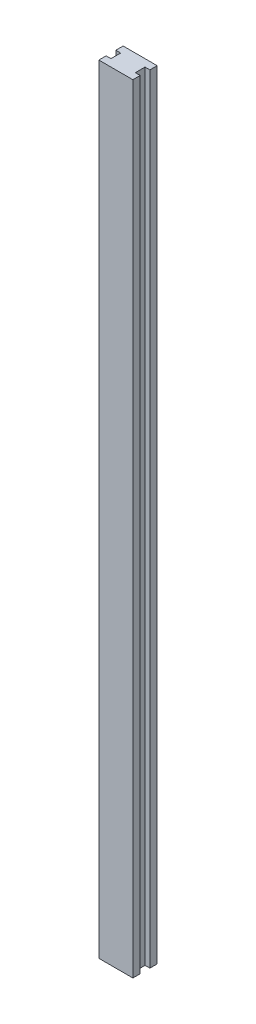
ISO-10303-21;
HEADER;
FILE_DESCRIPTION(('STEP AP214'),'2;1');
FILE_NAME('part.step','',(''),(''),'','','');
FILE_SCHEMA(('AUTOMOTIVE_DESIGN { 1 0 10303 214 1 1 1 1 }'));
ENDSEC;
DATA;
#1=APPLICATION_CONTEXT('core data for automotive mechanical design processes');
#2=APPLICATION_PROTOCOL_DEFINITION('international standard','automotive_design',2000,#1);
#3=PRODUCT_CONTEXT('',#1,'mechanical');
#4=PRODUCT('Part','Part','',(#3));
#5=PRODUCT_RELATED_PRODUCT_CATEGORY('part','',(#4));
#6=PRODUCT_DEFINITION_FORMATION('','',#4);
#7=PRODUCT_DEFINITION_CONTEXT('part definition',#1,'design');
#8=PRODUCT_DEFINITION('design','',#6,#7);
#9=PRODUCT_DEFINITION_SHAPE('','',#8);
#10=(LENGTH_UNIT() NAMED_UNIT(*) SI_UNIT(.MILLI.,.METRE.));
#11=(NAMED_UNIT(*) PLANE_ANGLE_UNIT() SI_UNIT($,.RADIAN.));
#12=(NAMED_UNIT(*) SI_UNIT($,.STERADIAN.) SOLID_ANGLE_UNIT());
#13=UNCERTAINTY_MEASURE_WITH_UNIT(LENGTH_MEASURE(1.E-05),#10,'distance_accuracy_value','');
#14=(GEOMETRIC_REPRESENTATION_CONTEXT(3) GLOBAL_UNCERTAINTY_ASSIGNED_CONTEXT((#13)) GLOBAL_UNIT_ASSIGNED_CONTEXT((#10,
#11,#12)) REPRESENTATION_CONTEXT('',''));
#15=CARTESIAN_POINT('',(0.,0.,0.));
#16=DIRECTION('',(0.,0.,1.));
#17=DIRECTION('',(1.,0.,0.));
#18=AXIS2_PLACEMENT_3D('',#15,#16,#17);
#19=CARTESIAN_POINT('',(3.5,160.,-1.));
#20=DIRECTION('',(-1.,0.,0.));
#21=DIRECTION('',(0.,0.,1.));
#22=AXIS2_PLACEMENT_3D('',#19,#20,#21);
#23=PLANE('',#22);
#24=DIRECTION('',(0.,0.,-1.));
#25=VECTOR('',#24,1.);
#26=CARTESIAN_POINT('',(3.5,0.,-1.));
#27=LINE('',#26,#25);
#28=CARTESIAN_POINT('',(3.5,0.,-1.));
#29=VERTEX_POINT('',#28);
#30=CARTESIAN_POINT('',(3.5,0.,-2.5));
#31=VERTEX_POINT('',#30);
#32=EDGE_CURVE('E161',#29,#31,#27,.T.);
#33=ORIENTED_EDGE('',*,*,#32,.T.);
#34=DIRECTION('',(0.,-1.,0.));
#35=VECTOR('',#34,1.);
#36=CARTESIAN_POINT('',(3.5,160.,-2.5));
#37=LINE('',#36,#35);
#38=CARTESIAN_POINT('',(3.5,160.,-2.5));
#39=VERTEX_POINT('',#38);
#40=EDGE_CURVE('E11',#39,#31,#37,.T.);
#41=ORIENTED_EDGE('',*,*,#40,.F.);
#42=DIRECTION('',(0.,0.,-1.));
#43=VECTOR('',#42,1.);
#44=CARTESIAN_POINT('',(3.5,160.,-1.));
#45=LINE('',#44,#43);
#46=CARTESIAN_POINT('',(3.5,160.,-1.));
#47=VERTEX_POINT('',#46);
#48=EDGE_CURVE('E183',#47,#39,#45,.T.);
#49=ORIENTED_EDGE('',*,*,#48,.F.);
#50=DIRECTION('',(0.,-1.,0.));
#51=VECTOR('',#50,1.);
#52=CARTESIAN_POINT('',(3.5,160.,-1.));
#53=LINE('',#52,#51);
#54=EDGE_CURVE('E157',#47,#29,#53,.T.);
#55=ORIENTED_EDGE('',*,*,#54,.T.);
#56=EDGE_LOOP('',(#33,#41,#49,#55));
#57=FACE_BOUND('',#56,.T.);
#58=ADVANCED_FACE('F41',(#57),#23,.F.);
#59=CARTESIAN_POINT('',(-3.5,160.,-2.5));
#60=DIRECTION('',(0.,0.,1.));
#61=DIRECTION('',(1.,0.,0.));
#62=AXIS2_PLACEMENT_3D('',#59,#60,#61);
#63=PLANE('',#62);
#64=DIRECTION('',(-1.,0.,0.));
#65=VECTOR('',#64,1.);
#66=CARTESIAN_POINT('',(-3.5,0.,-2.5));
#67=LINE('',#66,#65);
#68=CARTESIAN_POINT('',(-3.5,0.,-2.5));
#69=VERTEX_POINT('',#68);
#70=EDGE_CURVE('E164',#31,#69,#67,.T.);
#71=ORIENTED_EDGE('',*,*,#70,.T.);
#72=DIRECTION('',(0.,-1.,0.));
#73=VECTOR('',#72,1.);
#74=CARTESIAN_POINT('',(-3.5,160.,-2.5));
#75=LINE('',#74,#73);
#76=CARTESIAN_POINT('',(-3.5,160.,-2.5));
#77=VERTEX_POINT('',#76);
#78=EDGE_CURVE('E49',#77,#69,#75,.T.);
#79=ORIENTED_EDGE('',*,*,#78,.F.);
#80=DIRECTION('',(-1.,0.,0.));
#81=VECTOR('',#80,1.);
#82=CARTESIAN_POINT('',(-3.5,160.,-2.5));
#83=LINE('',#82,#81);
#84=EDGE_CURVE('E112',#39,#77,#83,.T.);
#85=ORIENTED_EDGE('',*,*,#84,.F.);
#86=ORIENTED_EDGE('',*,*,#40,.T.);
#87=EDGE_LOOP('',(#71,#79,#85,#86));
#88=FACE_BOUND('',#87,.T.);
#89=ADVANCED_FACE('F261',(#88),#63,.F.);
#90=CARTESIAN_POINT('',(-3.5,160.,-1.));
#91=DIRECTION('',(1.,0.,0.));
#92=DIRECTION('',(0.,0.,-1.));
#93=AXIS2_PLACEMENT_3D('',#90,#91,#92);
#94=PLANE('',#93);
#95=DIRECTION('',(0.,0.,1.));
#96=VECTOR('',#95,1.);
#97=CARTESIAN_POINT('',(-3.5,0.,-1.));
#98=LINE('',#97,#96);
#99=CARTESIAN_POINT('',(-3.5,0.,-1.));
#100=VERTEX_POINT('',#99);
#101=EDGE_CURVE('E166',#69,#100,#98,.T.);
#102=ORIENTED_EDGE('',*,*,#101,.T.);
#103=DIRECTION('',(0.,-1.,0.));
#104=VECTOR('',#103,1.);
#105=CARTESIAN_POINT('',(-3.5,160.,-1.));
#106=LINE('',#105,#104);
#107=CARTESIAN_POINT('',(-3.5,160.,-1.));
#108=VERTEX_POINT('',#107);
#109=EDGE_CURVE('E202',#108,#100,#106,.T.);
#110=ORIENTED_EDGE('',*,*,#109,.F.);
#111=DIRECTION('',(0.,0.,1.));
#112=VECTOR('',#111,1.);
#113=CARTESIAN_POINT('',(-3.5,160.,-1.));
#114=LINE('',#113,#112);
#115=EDGE_CURVE('E210',#77,#108,#114,.T.);
#116=ORIENTED_EDGE('',*,*,#115,.F.);
#117=ORIENTED_EDGE('',*,*,#78,.T.);
#118=EDGE_LOOP('',(#102,#110,#116,#117));
#119=FACE_BOUND('',#118,.T.);
#120=ADVANCED_FACE('F208',(#119),#94,.F.);
#121=CARTESIAN_POINT('',(-3.5,160.,-1.));
#122=DIRECTION('',(0.,0.,-1.));
#123=DIRECTION('',(-1.,0.,0.));
#124=AXIS2_PLACEMENT_3D('',#121,#122,#123);
#125=PLANE('',#124);
#126=DIRECTION('',(1.,0.,0.));
#127=VECTOR('',#126,1.);
#128=CARTESIAN_POINT('',(-3.5,0.,-1.));
#129=LINE('',#128,#127);
#130=CARTESIAN_POINT('',(-2.5,0.,-1.));
#131=VERTEX_POINT('',#130);
#132=EDGE_CURVE('E168',#100,#131,#129,.T.);
#133=ORIENTED_EDGE('',*,*,#132,.T.);
#134=DIRECTION('',(0.,-1.,0.));
#135=VECTOR('',#134,1.);
#136=CARTESIAN_POINT('',(-2.5,160.,-1.));
#137=LINE('',#136,#135);
#138=CARTESIAN_POINT('',(-2.5,160.,-1.));
#139=VERTEX_POINT('',#138);
#140=EDGE_CURVE('E199',#139,#131,#137,.T.);
#141=ORIENTED_EDGE('',*,*,#140,.F.);
#142=DIRECTION('',(1.,0.,0.));
#143=VECTOR('',#142,1.);
#144=CARTESIAN_POINT('',(-3.5,160.,-1.));
#145=LINE('',#144,#143);
#146=EDGE_CURVE('E228',#108,#139,#145,.T.);
#147=ORIENTED_EDGE('',*,*,#146,.F.);
#148=ORIENTED_EDGE('',*,*,#109,.T.);
#149=EDGE_LOOP('',(#133,#141,#147,#148));
#150=FACE_BOUND('',#149,.T.);
#151=ADVANCED_FACE('F219',(#150),#125,.F.);
#152=CARTESIAN_POINT('',(-2.5,160.,1.));
#153=DIRECTION('',(1.,0.,0.));
#154=DIRECTION('',(0.,0.,-1.));
#155=AXIS2_PLACEMENT_3D('',#152,#153,#154);
#156=PLANE('',#155);
#157=DIRECTION('',(0.,0.,1.));
#158=VECTOR('',#157,1.);
#159=CARTESIAN_POINT('',(-2.5,0.,1.));
#160=LINE('',#159,#158);
#161=CARTESIAN_POINT('',(-2.5,0.,1.));
#162=VERTEX_POINT('',#161);
#163=EDGE_CURVE('E170',#131,#162,#160,.T.);
#164=ORIENTED_EDGE('',*,*,#163,.T.);
#165=DIRECTION('',(0.,-1.,0.));
#166=VECTOR('',#165,1.);
#167=CARTESIAN_POINT('',(-2.5,160.,1.));
#168=LINE('',#167,#166);
#169=CARTESIAN_POINT('',(-2.5,160.,1.));
#170=VERTEX_POINT('',#169);
#171=EDGE_CURVE('E196',#170,#162,#168,.T.);
#172=ORIENTED_EDGE('',*,*,#171,.F.);
#173=DIRECTION('',(0.,0.,1.));
#174=VECTOR('',#173,1.);
#175=CARTESIAN_POINT('',(-2.5,160.,1.));
#176=LINE('',#175,#174);
#177=EDGE_CURVE('E225',#139,#170,#176,.T.);
#178=ORIENTED_EDGE('',*,*,#177,.F.);
#179=ORIENTED_EDGE('',*,*,#140,.T.);
#180=EDGE_LOOP('',(#164,#172,#178,#179));
#181=FACE_BOUND('',#180,.T.);
#182=ADVANCED_FACE('F223',(#181),#156,.F.);
#183=CARTESIAN_POINT('',(-3.5,160.,1.));
#184=DIRECTION('',(0.,0.,1.));
#185=DIRECTION('',(1.,0.,0.));
#186=AXIS2_PLACEMENT_3D('',#183,#184,#185);
#187=PLANE('',#186);
#188=DIRECTION('',(-1.,0.,0.));
#189=VECTOR('',#188,1.);
#190=CARTESIAN_POINT('',(-3.5,0.,1.));
#191=LINE('',#190,#189);
#192=CARTESIAN_POINT('',(-3.5,0.,1.));
#193=VERTEX_POINT('',#192);
#194=EDGE_CURVE('E172',#162,#193,#191,.T.);
#195=ORIENTED_EDGE('',*,*,#194,.T.);
#196=DIRECTION('',(0.,-1.,0.));
#197=VECTOR('',#196,1.);
#198=CARTESIAN_POINT('',(-3.5,160.,1.));
#199=LINE('',#198,#197);
#200=CARTESIAN_POINT('',(-3.5,160.,1.));
#201=VERTEX_POINT('',#200);
#202=EDGE_CURVE('E193',#201,#193,#199,.T.);
#203=ORIENTED_EDGE('',*,*,#202,.F.);
#204=DIRECTION('',(-1.,0.,0.));
#205=VECTOR('',#204,1.);
#206=CARTESIAN_POINT('',(-3.5,160.,1.));
#207=LINE('',#206,#205);
#208=EDGE_CURVE('E227',#170,#201,#207,.T.);
#209=ORIENTED_EDGE('',*,*,#208,.F.);
#210=ORIENTED_EDGE('',*,*,#171,.T.);
#211=EDGE_LOOP('',(#195,#203,#209,#210));
#212=FACE_BOUND('',#211,.T.);
#213=ADVANCED_FACE('F274',(#212),#187,.F.);
#214=CARTESIAN_POINT('',(-3.5,160.,2.5));
#215=DIRECTION('',(1.,0.,0.));
#216=DIRECTION('',(0.,0.,-1.));
#217=AXIS2_PLACEMENT_3D('',#214,#215,#216);
#218=PLANE('',#217);
#219=DIRECTION('',(0.,0.,1.));
#220=VECTOR('',#219,1.);
#221=CARTESIAN_POINT('',(-3.5,0.,2.5));
#222=LINE('',#221,#220);
#223=CARTESIAN_POINT('',(-3.5,0.,2.5));
#224=VERTEX_POINT('',#223);
#225=EDGE_CURVE('E174',#193,#224,#222,.T.);
#226=ORIENTED_EDGE('',*,*,#225,.T.);
#227=DIRECTION('',(0.,-1.,0.));
#228=VECTOR('',#227,1.);
#229=CARTESIAN_POINT('',(-3.5,160.,2.5));
#230=LINE('',#229,#228);
#231=CARTESIAN_POINT('',(-3.5,160.,2.5));
#232=VERTEX_POINT('',#231);
#233=EDGE_CURVE('E190',#232,#224,#230,.T.);
#234=ORIENTED_EDGE('',*,*,#233,.F.);
#235=DIRECTION('',(0.,0.,1.));
#236=VECTOR('',#235,1.);
#237=CARTESIAN_POINT('',(-3.5,160.,2.5));
#238=LINE('',#237,#236);
#239=EDGE_CURVE('E230',#201,#232,#238,.T.);
#240=ORIENTED_EDGE('',*,*,#239,.F.);
#241=ORIENTED_EDGE('',*,*,#202,.T.);
#242=EDGE_LOOP('',(#226,#234,#240,#241));
#243=FACE_BOUND('',#242,.T.);
#244=ADVANCED_FACE('F277',(#243),#218,.F.);
#245=CARTESIAN_POINT('',(-3.5,160.,2.5));
#246=DIRECTION('',(0.,0.,-1.));
#247=DIRECTION('',(-1.,0.,0.));
#248=AXIS2_PLACEMENT_3D('',#245,#246,#247);
#249=PLANE('',#248);
#250=DIRECTION('',(1.,0.,0.));
#251=VECTOR('',#250,1.);
#252=CARTESIAN_POINT('',(-3.5,0.,2.5));
#253=LINE('',#252,#251);
#254=CARTESIAN_POINT('',(3.5,0.,2.5));
#255=VERTEX_POINT('',#254);
#256=EDGE_CURVE('E176',#224,#255,#253,.T.);
#257=ORIENTED_EDGE('',*,*,#256,.T.);
#258=DIRECTION('',(0.,-1.,0.));
#259=VECTOR('',#258,1.);
#260=CARTESIAN_POINT('',(3.5,160.,2.5));
#261=LINE('',#260,#259);
#262=CARTESIAN_POINT('',(3.5,160.,2.5));
#263=VERTEX_POINT('',#262);
#264=EDGE_CURVE('E187',#263,#255,#261,.T.);
#265=ORIENTED_EDGE('',*,*,#264,.F.);
#266=DIRECTION('',(1.,0.,0.));
#267=VECTOR('',#266,1.);
#268=CARTESIAN_POINT('',(-3.5,160.,2.5));
#269=LINE('',#268,#267);
#270=EDGE_CURVE('E236',#232,#263,#269,.T.);
#271=ORIENTED_EDGE('',*,*,#270,.F.);
#272=ORIENTED_EDGE('',*,*,#233,.T.);
#273=EDGE_LOOP('',(#257,#265,#271,#272));
#274=FACE_BOUND('',#273,.T.);
#275=ADVANCED_FACE('F242',(#274),#249,.F.);
#276=CARTESIAN_POINT('',(3.5,160.,2.5));
#277=DIRECTION('',(-1.,0.,0.));
#278=DIRECTION('',(0.,0.,1.));
#279=AXIS2_PLACEMENT_3D('',#276,#277,#278);
#280=PLANE('',#279);
#281=DIRECTION('',(0.,0.,-1.));
#282=VECTOR('',#281,1.);
#283=CARTESIAN_POINT('',(3.5,0.,2.5));
#284=LINE('',#283,#282);
#285=CARTESIAN_POINT('',(3.5,0.,0.999999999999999));
#286=VERTEX_POINT('',#285);
#287=EDGE_CURVE('E178',#255,#286,#284,.T.);
#288=ORIENTED_EDGE('',*,*,#287,.T.);
#289=DIRECTION('',(0.,-1.,0.));
#290=VECTOR('',#289,1.);
#291=CARTESIAN_POINT('',(3.5,160.,0.999999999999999));
#292=LINE('',#291,#290);
#293=CARTESIAN_POINT('',(3.5,160.,0.999999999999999));
#294=VERTEX_POINT('',#293);
#295=EDGE_CURVE('E152',#294,#286,#292,.T.);
#296=ORIENTED_EDGE('',*,*,#295,.F.);
#297=DIRECTION('',(0.,0.,-1.));
#298=VECTOR('',#297,1.);
#299=CARTESIAN_POINT('',(3.5,160.,2.5));
#300=LINE('',#299,#298);
#301=EDGE_CURVE('E143',#263,#294,#300,.T.);
#302=ORIENTED_EDGE('',*,*,#301,.F.);
#303=ORIENTED_EDGE('',*,*,#264,.T.);
#304=EDGE_LOOP('',(#288,#296,#302,#303));
#305=FACE_BOUND('',#304,.T.);
#306=ADVANCED_FACE('F246',(#305),#280,.F.);
#307=CARTESIAN_POINT('',(2.5,160.,0.999999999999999));
#308=DIRECTION('',(0.,0.,1.));
#309=DIRECTION('',(1.,0.,0.));
#310=AXIS2_PLACEMENT_3D('',#307,#308,#309);
#311=PLANE('',#310);
#312=DIRECTION('',(-1.,0.,0.));
#313=VECTOR('',#312,1.);
#314=CARTESIAN_POINT('',(2.5,0.,0.999999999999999));
#315=LINE('',#314,#313);
#316=CARTESIAN_POINT('',(2.5,0.,0.999999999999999));
#317=VERTEX_POINT('',#316);
#318=EDGE_CURVE('E151',#286,#317,#315,.T.);
#319=ORIENTED_EDGE('',*,*,#318,.T.);
#320=DIRECTION('',(0.,-1.,0.));
#321=VECTOR('',#320,1.);
#322=CARTESIAN_POINT('',(2.5,160.,0.999999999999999));
#323=LINE('',#322,#321);
#324=CARTESIAN_POINT('',(2.5,160.,0.999999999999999));
#325=VERTEX_POINT('',#324);
#326=EDGE_CURVE('E148',#325,#317,#323,.T.);
#327=ORIENTED_EDGE('',*,*,#326,.F.);
#328=DIRECTION('',(-1.,0.,0.));
#329=VECTOR('',#328,1.);
#330=CARTESIAN_POINT('',(2.5,160.,0.999999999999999));
#331=LINE('',#330,#329);
#332=EDGE_CURVE('E137',#294,#325,#331,.T.);
#333=ORIENTED_EDGE('',*,*,#332,.F.);
#334=ORIENTED_EDGE('',*,*,#295,.T.);
#335=EDGE_LOOP('',(#319,#327,#333,#334));
#336=FACE_BOUND('',#335,.T.);
#337=ADVANCED_FACE('F149',(#336),#311,.F.);
#338=CARTESIAN_POINT('',(2.5,160.,0.999999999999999));
#339=DIRECTION('',(-1.,0.,0.));
#340=DIRECTION('',(0.,0.,1.));
#341=AXIS2_PLACEMENT_3D('',#338,#339,#340);
#342=PLANE('',#341);
#343=DIRECTION('',(0.,0.,-1.));
#344=VECTOR('',#343,1.);
#345=CARTESIAN_POINT('',(2.5,0.,0.999999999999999));
#346=LINE('',#345,#344);
#347=CARTESIAN_POINT('',(2.5,0.,-1.));
#348=VERTEX_POINT('',#347);
#349=EDGE_CURVE('E98',#317,#348,#346,.T.);
#350=ORIENTED_EDGE('',*,*,#349,.T.);
#351=DIRECTION('',(0.,-1.,0.));
#352=VECTOR('',#351,1.);
#353=CARTESIAN_POINT('',(2.5,160.,-1.));
#354=LINE('',#353,#352);
#355=CARTESIAN_POINT('',(2.5,160.,-1.));
#356=VERTEX_POINT('',#355);
#357=EDGE_CURVE('E153',#356,#348,#354,.T.);
#358=ORIENTED_EDGE('',*,*,#357,.F.);
#359=DIRECTION('',(0.,0.,-1.));
#360=VECTOR('',#359,1.);
#361=CARTESIAN_POINT('',(2.5,160.,0.999999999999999));
#362=LINE('',#361,#360);
#363=EDGE_CURVE('E141',#325,#356,#362,.T.);
#364=ORIENTED_EDGE('',*,*,#363,.F.);
#365=ORIENTED_EDGE('',*,*,#326,.T.);
#366=EDGE_LOOP('',(#350,#358,#364,#365));
#367=FACE_BOUND('',#366,.T.);
#368=ADVANCED_FACE('F155',(#367),#342,.F.);
#369=CARTESIAN_POINT('',(2.5,160.,-1.));
#370=DIRECTION('',(0.,0.,-1.));
#371=DIRECTION('',(-1.,0.,0.));
#372=AXIS2_PLACEMENT_3D('',#369,#370,#371);
#373=PLANE('',#372);
#374=DIRECTION('',(1.,0.,0.));
#375=VECTOR('',#374,1.);
#376=CARTESIAN_POINT('',(2.5,0.,-1.));
#377=LINE('',#376,#375);
#378=EDGE_CURVE('E104',#348,#29,#377,.T.);
#379=ORIENTED_EDGE('',*,*,#378,.T.);
#380=ORIENTED_EDGE('',*,*,#54,.F.);
#381=DIRECTION('',(1.,0.,0.));
#382=VECTOR('',#381,1.);
#383=CARTESIAN_POINT('',(2.5,160.,-1.));
#384=LINE('',#383,#382);
#385=EDGE_CURVE('E57',#356,#47,#384,.T.);
#386=ORIENTED_EDGE('',*,*,#385,.F.);
#387=ORIENTED_EDGE('',*,*,#357,.T.);
#388=EDGE_LOOP('',(#379,#380,#386,#387));
#389=FACE_BOUND('',#388,.T.);
#390=ADVANCED_FACE('F250',(#389),#373,.F.);
#391=CARTESIAN_POINT('',(0.,160.,0.));
#392=DIRECTION('',(0.,-1.,0.));
#393=DIRECTION('',(0.,0.,-1.));
#394=AXIS2_PLACEMENT_3D('',#391,#392,#393);
#395=PLANE('',#394);
#396=ORIENTED_EDGE('',*,*,#48,.T.);
#397=ORIENTED_EDGE('',*,*,#84,.T.);
#398=ORIENTED_EDGE('',*,*,#115,.T.);
#399=ORIENTED_EDGE('',*,*,#146,.T.);
#400=ORIENTED_EDGE('',*,*,#177,.T.);
#401=ORIENTED_EDGE('',*,*,#208,.T.);
#402=ORIENTED_EDGE('',*,*,#239,.T.);
#403=ORIENTED_EDGE('',*,*,#270,.T.);
#404=ORIENTED_EDGE('',*,*,#301,.T.);
#405=ORIENTED_EDGE('',*,*,#332,.T.);
#406=ORIENTED_EDGE('',*,*,#363,.T.);
#407=ORIENTED_EDGE('',*,*,#385,.T.);
#408=EDGE_LOOP('',(#396,#397,#398,#399,#400,#401,#402,#403,#404,#405,#406,#407));
#409=FACE_BOUND('',#408,.T.);
#410=ADVANCED_FACE('F139',(#409),#395,.F.);
#411=CARTESIAN_POINT('',(0.,0.,0.));
#412=DIRECTION('',(0.,-1.,0.));
#413=DIRECTION('',(0.,0.,-1.));
#414=AXIS2_PLACEMENT_3D('',#411,#412,#413);
#415=PLANE('',#414);
#416=ORIENTED_EDGE('',*,*,#32,.F.);
#417=ORIENTED_EDGE('',*,*,#378,.F.);
#418=ORIENTED_EDGE('',*,*,#349,.F.);
#419=ORIENTED_EDGE('',*,*,#318,.F.);
#420=ORIENTED_EDGE('',*,*,#287,.F.);
#421=ORIENTED_EDGE('',*,*,#256,.F.);
#422=ORIENTED_EDGE('',*,*,#225,.F.);
#423=ORIENTED_EDGE('',*,*,#194,.F.);
#424=ORIENTED_EDGE('',*,*,#163,.F.);
#425=ORIENTED_EDGE('',*,*,#132,.F.);
#426=ORIENTED_EDGE('',*,*,#101,.F.);
#427=ORIENTED_EDGE('',*,*,#70,.F.);
#428=EDGE_LOOP('',(#416,#417,#418,#419,#420,#421,#422,#423,#424,#425,#426,#427));
#429=FACE_BOUND('',#428,.T.);
#430=ADVANCED_FACE('F214',(#429),#415,.T.);
#431=CLOSED_SHELL('',(#58,#89,#120,#151,#182,#213,#244,#275,#306,#337,#368,#390,#410,#430));
#432=MANIFOLD_SOLID_BREP('B2',#431);
#433=ADVANCED_BREP_SHAPE_REPRESENTATION('',(#18,#432),#14);
#434=SHAPE_DEFINITION_REPRESENTATION(#9,#433);
ENDSEC;
END-ISO-10303-21;
